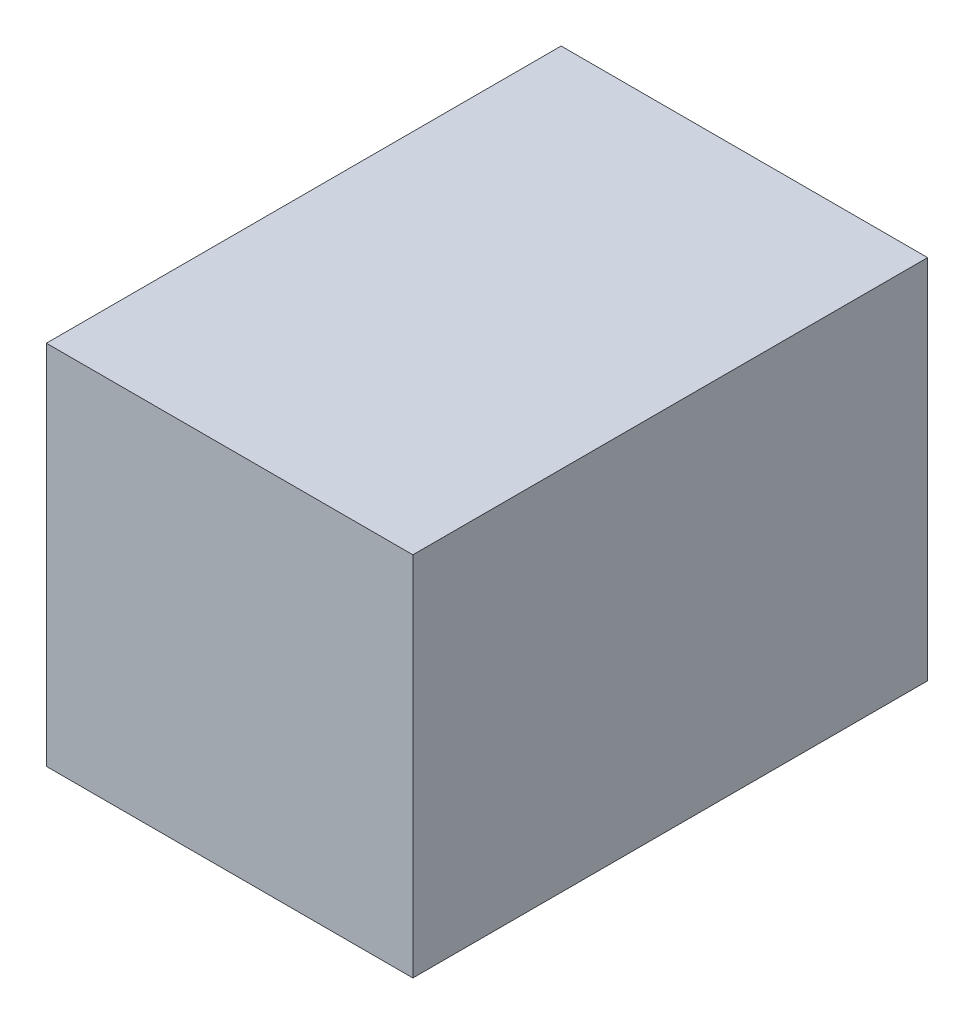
ISO-10303-21;
HEADER;
FILE_DESCRIPTION(('STEP AP214'),'2;1');
FILE_NAME('part.step','',(''),(''),'','','');
FILE_SCHEMA(('AUTOMOTIVE_DESIGN { 1 0 10303 214 1 1 1 1 }'));
ENDSEC;
DATA;
#1=APPLICATION_CONTEXT('core data for automotive mechanical design processes');
#2=APPLICATION_PROTOCOL_DEFINITION('international standard','automotive_design',2000,#1);
#3=PRODUCT_CONTEXT('',#1,'mechanical');
#4=PRODUCT('Part','Part','',(#3));
#5=PRODUCT_RELATED_PRODUCT_CATEGORY('part','',(#4));
#6=PRODUCT_DEFINITION_FORMATION('','',#4);
#7=PRODUCT_DEFINITION_CONTEXT('part definition',#1,'design');
#8=PRODUCT_DEFINITION('design','',#6,#7);
#9=PRODUCT_DEFINITION_SHAPE('','',#8);
#10=(LENGTH_UNIT() NAMED_UNIT(*) SI_UNIT(.MILLI.,.METRE.));
#11=(NAMED_UNIT(*) PLANE_ANGLE_UNIT() SI_UNIT($,.RADIAN.));
#12=(NAMED_UNIT(*) SI_UNIT($,.STERADIAN.) SOLID_ANGLE_UNIT());
#13=UNCERTAINTY_MEASURE_WITH_UNIT(LENGTH_MEASURE(1.E-05),#10,'distance_accuracy_value','');
#14=(GEOMETRIC_REPRESENTATION_CONTEXT(3) GLOBAL_UNCERTAINTY_ASSIGNED_CONTEXT((#13)) GLOBAL_UNIT_ASSIGNED_CONTEXT((#10,
#11,#12)) REPRESENTATION_CONTEXT('',''));
#15=CARTESIAN_POINT('',(0.,0.,0.));
#16=DIRECTION('',(0.,0.,1.));
#17=DIRECTION('',(1.,0.,0.));
#18=AXIS2_PLACEMENT_3D('',#15,#16,#17);
#19=CARTESIAN_POINT('',(71.2,-71.2,100.));
#20=DIRECTION('',(-1.,0.,0.));
#21=DIRECTION('',(0.,0.,1.));
#22=AXIS2_PLACEMENT_3D('',#19,#20,#21);
#23=PLANE('',#22);
#24=DIRECTION('',(0.,1.,0.));
#25=VECTOR('',#24,1.);
#26=CARTESIAN_POINT('',(71.2,-71.2,-100.));
#27=LINE('',#26,#25);
#28=CARTESIAN_POINT('',(71.2,-71.2,-100.));
#29=VERTEX_POINT('',#28);
#30=CARTESIAN_POINT('',(71.2,71.2,-100.));
#31=VERTEX_POINT('',#30);
#32=EDGE_CURVE('E97',#29,#31,#27,.T.);
#33=ORIENTED_EDGE('',*,*,#32,.T.);
#34=DIRECTION('',(0.,0.,-1.));
#35=VECTOR('',#34,1.);
#36=CARTESIAN_POINT('',(71.2,71.2,100.));
#37=LINE('',#36,#35);
#38=CARTESIAN_POINT('',(71.2,71.2,100.));
#39=VERTEX_POINT('',#38);
#40=EDGE_CURVE('E11',#39,#31,#37,.T.);
#41=ORIENTED_EDGE('',*,*,#40,.F.);
#42=DIRECTION('',(0.,1.,0.));
#43=VECTOR('',#42,1.);
#44=CARTESIAN_POINT('',(71.2,-71.2,100.));
#45=LINE('',#44,#43);
#46=CARTESIAN_POINT('',(71.2,-71.2,100.));
#47=VERTEX_POINT('',#46);
#48=EDGE_CURVE('E85',#47,#39,#45,.T.);
#49=ORIENTED_EDGE('',*,*,#48,.F.);
#50=DIRECTION('',(0.,0.,-1.));
#51=VECTOR('',#50,1.);
#52=CARTESIAN_POINT('',(71.2,-71.2,100.));
#53=LINE('',#52,#51);
#54=EDGE_CURVE('E93',#47,#29,#53,.T.);
#55=ORIENTED_EDGE('',*,*,#54,.T.);
#56=EDGE_LOOP('',(#33,#41,#49,#55));
#57=FACE_BOUND('',#56,.T.);
#58=ADVANCED_FACE('F34',(#57),#23,.F.);
#59=CARTESIAN_POINT('',(-71.2,71.2,100.));
#60=DIRECTION('',(0.,-1.,0.));
#61=DIRECTION('',(0.,0.,-1.));
#62=AXIS2_PLACEMENT_3D('',#59,#60,#61);
#63=PLANE('',#62);
#64=DIRECTION('',(-1.,0.,0.));
#65=VECTOR('',#64,1.);
#66=CARTESIAN_POINT('',(-71.2,71.2,-100.));
#67=LINE('',#66,#65);
#68=CARTESIAN_POINT('',(-71.2,71.2,-100.));
#69=VERTEX_POINT('',#68);
#70=EDGE_CURVE('E89',#31,#69,#67,.T.);
#71=ORIENTED_EDGE('',*,*,#70,.T.);
#72=DIRECTION('',(0.,0.,-1.));
#73=VECTOR('',#72,1.);
#74=CARTESIAN_POINT('',(-71.2,71.2,100.));
#75=LINE('',#74,#73);
#76=CARTESIAN_POINT('',(-71.2,71.2,100.));
#77=VERTEX_POINT('',#76);
#78=EDGE_CURVE('E42',#77,#69,#75,.T.);
#79=ORIENTED_EDGE('',*,*,#78,.F.);
#80=DIRECTION('',(-1.,0.,0.));
#81=VECTOR('',#80,1.);
#82=CARTESIAN_POINT('',(-71.2,71.2,100.));
#83=LINE('',#82,#81);
#84=EDGE_CURVE('E80',#39,#77,#83,.T.);
#85=ORIENTED_EDGE('',*,*,#84,.F.);
#86=ORIENTED_EDGE('',*,*,#40,.T.);
#87=EDGE_LOOP('',(#71,#79,#85,#86));
#88=FACE_BOUND('',#87,.T.);
#89=ADVANCED_FACE('F88',(#88),#63,.F.);
#90=CARTESIAN_POINT('',(-71.2,-71.2,100.));
#91=DIRECTION('',(1.,0.,0.));
#92=DIRECTION('',(0.,0.,-1.));
#93=AXIS2_PLACEMENT_3D('',#90,#91,#92);
#94=PLANE('',#93);
#95=DIRECTION('',(0.,-1.,0.));
#96=VECTOR('',#95,1.);
#97=CARTESIAN_POINT('',(-71.2,-71.2,-100.));
#98=LINE('',#97,#96);
#99=CARTESIAN_POINT('',(-71.2,-71.2,-100.));
#100=VERTEX_POINT('',#99);
#101=EDGE_CURVE('E67',#69,#100,#98,.T.);
#102=ORIENTED_EDGE('',*,*,#101,.T.);
#103=DIRECTION('',(0.,0.,-1.));
#104=VECTOR('',#103,1.);
#105=CARTESIAN_POINT('',(-71.2,-71.2,100.));
#106=LINE('',#105,#104);
#107=CARTESIAN_POINT('',(-71.2,-71.2,100.));
#108=VERTEX_POINT('',#107);
#109=EDGE_CURVE('E90',#108,#100,#106,.T.);
#110=ORIENTED_EDGE('',*,*,#109,.F.);
#111=DIRECTION('',(0.,-1.,0.));
#112=VECTOR('',#111,1.);
#113=CARTESIAN_POINT('',(-71.2,-71.2,100.));
#114=LINE('',#113,#112);
#115=EDGE_CURVE('E83',#77,#108,#114,.T.);
#116=ORIENTED_EDGE('',*,*,#115,.F.);
#117=ORIENTED_EDGE('',*,*,#78,.T.);
#118=EDGE_LOOP('',(#102,#110,#116,#117));
#119=FACE_BOUND('',#118,.T.);
#120=ADVANCED_FACE('F91',(#119),#94,.F.);
#121=CARTESIAN_POINT('',(-71.2,-71.2,100.));
#122=DIRECTION('',(0.,1.,0.));
#123=DIRECTION('',(0.,0.,1.));
#124=AXIS2_PLACEMENT_3D('',#121,#122,#123);
#125=PLANE('',#124);
#126=DIRECTION('',(1.,0.,0.));
#127=VECTOR('',#126,1.);
#128=CARTESIAN_POINT('',(-71.2,-71.2,-100.));
#129=LINE('',#128,#127);
#130=EDGE_CURVE('E73',#100,#29,#129,.T.);
#131=ORIENTED_EDGE('',*,*,#130,.T.);
#132=ORIENTED_EDGE('',*,*,#54,.F.);
#133=DIRECTION('',(1.,0.,0.));
#134=VECTOR('',#133,1.);
#135=CARTESIAN_POINT('',(-71.2,-71.2,100.));
#136=LINE('',#135,#134);
#137=EDGE_CURVE('E50',#108,#47,#136,.T.);
#138=ORIENTED_EDGE('',*,*,#137,.F.);
#139=ORIENTED_EDGE('',*,*,#109,.T.);
#140=EDGE_LOOP('',(#131,#132,#138,#139));
#141=FACE_BOUND('',#140,.T.);
#142=ADVANCED_FACE('F105',(#141),#125,.F.);
#143=CARTESIAN_POINT('',(0.,0.,100.));
#144=DIRECTION('',(0.,0.,-1.));
#145=DIRECTION('',(-1.,0.,0.));
#146=AXIS2_PLACEMENT_3D('',#143,#144,#145);
#147=PLANE('',#146);
#148=ORIENTED_EDGE('',*,*,#48,.T.);
#149=ORIENTED_EDGE('',*,*,#84,.T.);
#150=ORIENTED_EDGE('',*,*,#115,.T.);
#151=ORIENTED_EDGE('',*,*,#137,.T.);
#152=EDGE_LOOP('',(#148,#149,#150,#151));
#153=FACE_BOUND('',#152,.T.);
#154=ADVANCED_FACE('F81',(#153),#147,.F.);
#155=CARTESIAN_POINT('',(0.,0.,-100.));
#156=DIRECTION('',(0.,0.,-1.));
#157=DIRECTION('',(-1.,0.,0.));
#158=AXIS2_PLACEMENT_3D('',#155,#156,#157);
#159=PLANE('',#158);
#160=ORIENTED_EDGE('',*,*,#32,.F.);
#161=ORIENTED_EDGE('',*,*,#130,.F.);
#162=ORIENTED_EDGE('',*,*,#101,.F.);
#163=ORIENTED_EDGE('',*,*,#70,.F.);
#164=EDGE_LOOP('',(#160,#161,#162,#163));
#165=FACE_BOUND('',#164,.T.);
#166=ADVANCED_FACE('F108',(#165),#159,.T.);
#167=CLOSED_SHELL('',(#58,#89,#120,#142,#154,#166));
#168=CARTESIAN_POINT('',(0.,0.,82.416));
#169=DIRECTION('',(0.,0.,-1.));
#170=DIRECTION('',(-1.,0.,0.));
#171=AXIS2_PLACEMENT_3D('',#168,#169,#170);
#172=PLANE('',#171);
#173=CARTESIAN_POINT('',(0.,0.,82.416));
#174=DIRECTION('',(0.,0.,1.));
#175=DIRECTION('',(1.,0.,0.));
#176=AXIS2_PLACEMENT_3D('',#173,#174,#175);
#177=CIRCLE('',#176,30.906);
#178=CARTESIAN_POINT('',(30.906,0.,82.416));
#179=VERTEX_POINT('',#178);
#180=EDGE_CURVE('E146',#179,#179,#177,.T.);
#181=ORIENTED_EDGE('',*,*,#180,.F.);
#182=EDGE_LOOP('',(#181));
#183=FACE_BOUND('',#182,.T.);
#184=ADVANCED_FACE('F153',(#183),#172,.T.);
#185=CARTESIAN_POINT('',(0.,0.,-82.416));
#186=DIRECTION('',(0.,0.,1.));
#187=DIRECTION('',(1.,0.,0.));
#188=AXIS2_PLACEMENT_3D('',#185,#186,#187);
#189=PLANE('',#188);
#190=CARTESIAN_POINT('',(0.,0.,-82.416));
#191=DIRECTION('',(0.,0.,1.));
#192=DIRECTION('',(1.,0.,0.));
#193=AXIS2_PLACEMENT_3D('',#190,#191,#192);
#194=CIRCLE('',#193,41.208);
#195=CARTESIAN_POINT('',(41.208,0.,-82.416));
#196=VERTEX_POINT('',#195);
#197=EDGE_CURVE('E100',#196,#196,#194,.T.);
#198=ORIENTED_EDGE('',*,*,#197,.T.);
#199=EDGE_LOOP('',(#198));
#200=FACE_BOUND('',#199,.T.);
#201=ADVANCED_FACE('F155',(#200),#189,.T.);
#202=CARTESIAN_POINT('',(0.,0.,-61.812));
#203=DIRECTION('',(0.,0.,1.));
#204=DIRECTION('',(1.,0.,0.));
#205=AXIS2_PLACEMENT_3D('',#202,#203,#204);
#206=TOROIDAL_SURFACE('',#205,41.208,20.604);
#207=CARTESIAN_POINT('',(0.,0.,-41.208));
#208=DIRECTION('',(0.,0.,1.));
#209=DIRECTION('',(1.,0.,0.));
#210=AXIS2_PLACEMENT_3D('',#207,#208,#209);
#211=CIRCLE('',#210,41.208);
#212=CARTESIAN_POINT('',(41.208,0.,-41.208));
#213=VERTEX_POINT('',#212);
#214=EDGE_CURVE('E113',#213,#213,#211,.T.);
#215=ORIENTED_EDGE('',*,*,#214,.T.);
#216=EDGE_LOOP('',(#215));
#217=FACE_BOUND('',#216,.T.);
#218=ORIENTED_EDGE('',*,*,#197,.F.);
#219=EDGE_LOOP('',(#218));
#220=FACE_BOUND('',#219,.T.);
#221=ADVANCED_FACE('F162',(#217,#220),#206,.F.);
#222=CARTESIAN_POINT('',(0.,0.,-41.208));
#223=DIRECTION('',(0.,0.,-1.));
#224=DIRECTION('',(-1.,0.,0.));
#225=AXIS2_PLACEMENT_3D('',#222,#223,#224);
#226=PLANE('',#225);
#227=CARTESIAN_POINT('',(0.,0.,-41.208));
#228=DIRECTION('',(0.,0.,1.));
#229=DIRECTION('',(1.,0.,0.));
#230=AXIS2_PLACEMENT_3D('',#227,#228,#229);
#231=CIRCLE('',#230,33.4815);
#232=CARTESIAN_POINT('',(33.4815,0.,-41.208));
#233=VERTEX_POINT('',#232);
#234=EDGE_CURVE('E116',#233,#233,#231,.T.);
#235=ORIENTED_EDGE('',*,*,#234,.T.);
#236=EDGE_LOOP('',(#235));
#237=FACE_BOUND('',#236,.T.);
#238=ORIENTED_EDGE('',*,*,#214,.F.);
#239=EDGE_LOOP('',(#238));
#240=FACE_BOUND('',#239,.T.);
#241=ADVANCED_FACE('F227',(#237,#240),#226,.T.);
#242=CARTESIAN_POINT('',(0.,0.,-38.6325));
#243=DIRECTION('',(0.,0.,1.));
#244=DIRECTION('',(1.,0.,0.));
#245=AXIS2_PLACEMENT_3D('',#242,#243,#244);
#246=TOROIDAL_SURFACE('',#245,33.4815,2.5755);
#247=ORIENTED_EDGE('',*,*,#234,.F.);
#248=EDGE_LOOP('',(#247));
#249=FACE_BOUND('',#248,.T.);
#250=CARTESIAN_POINT('',(0.,0.,-38.6325));
#251=DIRECTION('',(0.,0.,1.));
#252=DIRECTION('',(1.,0.,0.));
#253=AXIS2_PLACEMENT_3D('',#250,#251,#252);
#254=CIRCLE('',#253,30.906);
#255=CARTESIAN_POINT('',(30.906,0.,-38.6325));
#256=VERTEX_POINT('',#255);
#257=EDGE_CURVE('E119',#256,#256,#254,.T.);
#258=ORIENTED_EDGE('',*,*,#257,.T.);
#259=EDGE_LOOP('',(#258));
#260=FACE_BOUND('',#259,.T.);
#261=ADVANCED_FACE('F236',(#249,#260),#246,.T.);
#262=CARTESIAN_POINT('',(0.,0.,82.416));
#263=DIRECTION('',(0.,0.,1.));
#264=DIRECTION('',(1.,0.,0.));
#265=AXIS2_PLACEMENT_3D('',#262,#263,#264);
#266=CYLINDRICAL_SURFACE('',#265,30.906);
#267=ORIENTED_EDGE('',*,*,#257,.F.);
#268=EDGE_LOOP('',(#267));
#269=FACE_BOUND('',#268,.T.);
#270=CARTESIAN_POINT('',(0.,0.,-2.57550000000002));
#271=DIRECTION('',(0.,0.,1.));
#272=DIRECTION('',(1.,0.,0.));
#273=AXIS2_PLACEMENT_3D('',#270,#271,#272);
#274=CIRCLE('',#273,30.906);
#275=CARTESIAN_POINT('',(30.906,0.,-2.57550000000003));
#276=VERTEX_POINT('',#275);
#277=EDGE_CURVE('E122',#276,#276,#274,.T.);
#278=ORIENTED_EDGE('',*,*,#277,.T.);
#279=EDGE_LOOP('',(#278));
#280=FACE_BOUND('',#279,.T.);
#281=ADVANCED_FACE('F246',(#269,#280),#266,.F.);
#282=CARTESIAN_POINT('',(0.,0.,-2.57550000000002));
#283=DIRECTION('',(0.,0.,1.));
#284=DIRECTION('',(1.,0.,0.));
#285=AXIS2_PLACEMENT_3D('',#282,#283,#284);
#286=TOROIDAL_SURFACE('',#285,28.3305,2.5755);
#287=CARTESIAN_POINT('',(0.,0.,0.));
#288=DIRECTION('',(0.,0.,1.));
#289=DIRECTION('',(1.,0.,0.));
#290=AXIS2_PLACEMENT_3D('',#287,#288,#289);
#291=CIRCLE('',#290,28.3305);
#292=CARTESIAN_POINT('',(28.3305,0.,0.));
#293=VERTEX_POINT('',#292);
#294=EDGE_CURVE('E125',#293,#293,#291,.T.);
#295=ORIENTED_EDGE('',*,*,#294,.T.);
#296=EDGE_LOOP('',(#295));
#297=FACE_BOUND('',#296,.T.);
#298=ORIENTED_EDGE('',*,*,#277,.F.);
#299=EDGE_LOOP('',(#298));
#300=FACE_BOUND('',#299,.T.);
#301=ADVANCED_FACE('F256',(#297,#300),#286,.F.);
#302=CARTESIAN_POINT('',(0.,0.,0.));
#303=DIRECTION('',(0.,0.,-1.));
#304=DIRECTION('',(-1.,0.,0.));
#305=AXIS2_PLACEMENT_3D('',#302,#303,#304);
#306=PLANE('',#305);
#307=CARTESIAN_POINT('',(0.,0.,0.));
#308=DIRECTION('',(0.,0.,1.));
#309=DIRECTION('',(1.,0.,0.));
#310=AXIS2_PLACEMENT_3D('',#307,#308,#309);
#311=CIRCLE('',#310,25.755);
#312=CARTESIAN_POINT('',(25.755,0.,0.));
#313=VERTEX_POINT('',#312);
#314=EDGE_CURVE('E128',#313,#313,#311,.T.);
#315=ORIENTED_EDGE('',*,*,#314,.T.);
#316=EDGE_LOOP('',(#315));
#317=FACE_BOUND('',#316,.T.);
#318=ORIENTED_EDGE('',*,*,#294,.F.);
#319=EDGE_LOOP('',(#318));
#320=FACE_BOUND('',#319,.T.);
#321=ADVANCED_FACE('F266',(#317,#320),#306,.T.);
#322=CARTESIAN_POINT('',(0.,0.,5.15099999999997));
#323=DIRECTION('',(0.,0.,1.));
#324=DIRECTION('',(1.,0.,0.));
#325=AXIS2_PLACEMENT_3D('',#322,#323,#324);
#326=TOROIDAL_SURFACE('',#325,25.755,5.151);
#327=ORIENTED_EDGE('',*,*,#314,.F.);
#328=EDGE_LOOP('',(#327));
#329=FACE_BOUND('',#328,.T.);
#330=CARTESIAN_POINT('',(0.,0.,5.15099999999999));
#331=DIRECTION('',(0.,0.,1.));
#332=DIRECTION('',(1.,0.,0.));
#333=AXIS2_PLACEMENT_3D('',#330,#331,#332);
#334=CIRCLE('',#333,20.604);
#335=CARTESIAN_POINT('',(20.604,0.,5.15099999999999));
#336=VERTEX_POINT('',#335);
#337=EDGE_CURVE('E131',#336,#336,#334,.T.);
#338=ORIENTED_EDGE('',*,*,#337,.T.);
#339=EDGE_LOOP('',(#338));
#340=FACE_BOUND('',#339,.T.);
#341=ADVANCED_FACE('F276',(#329,#340),#326,.T.);
#342=CARTESIAN_POINT('',(0.,0.,82.416));
#343=DIRECTION('',(0.,0.,1.));
#344=DIRECTION('',(1.,0.,0.));
#345=AXIS2_PLACEMENT_3D('',#342,#343,#344);
#346=CYLINDRICAL_SURFACE('',#345,20.604);
#347=CARTESIAN_POINT('',(0.,0.,20.604));
#348=DIRECTION('',(0.,0.,1.));
#349=DIRECTION('',(1.,0.,0.));
#350=AXIS2_PLACEMENT_3D('',#347,#348,#349);
#351=CIRCLE('',#350,20.604);
#352=CARTESIAN_POINT('',(20.604,0.,20.604));
#353=VERTEX_POINT('',#352);
#354=EDGE_CURVE('E134',#353,#353,#351,.T.);
#355=ORIENTED_EDGE('',*,*,#354,.T.);
#356=EDGE_LOOP('',(#355));
#357=FACE_BOUND('',#356,.T.);
#358=ORIENTED_EDGE('',*,*,#337,.F.);
#359=EDGE_LOOP('',(#358));
#360=FACE_BOUND('',#359,.T.);
#361=ADVANCED_FACE('F286',(#357,#360),#346,.F.);
#362=CARTESIAN_POINT('',(0.,0.,20.604));
#363=DIRECTION('',(0.,0.,1.));
#364=DIRECTION('',(1.,0.,0.));
#365=AXIS2_PLACEMENT_3D('',#362,#363,#364);
#366=TOROIDAL_SURFACE('',#365,30.906,10.302);
#367=ORIENTED_EDGE('',*,*,#354,.F.);
#368=EDGE_LOOP('',(#367));
#369=FACE_BOUND('',#368,.T.);
#370=CARTESIAN_POINT('',(0.,0.,30.906));
#371=DIRECTION('',(0.,0.,1.));
#372=DIRECTION('',(1.,0.,0.));
#373=AXIS2_PLACEMENT_3D('',#370,#371,#372);
#374=CIRCLE('',#373,30.906);
#375=CARTESIAN_POINT('',(30.906,0.,30.906));
#376=VERTEX_POINT('',#375);
#377=EDGE_CURVE('E137',#376,#376,#374,.T.);
#378=ORIENTED_EDGE('',*,*,#377,.T.);
#379=EDGE_LOOP('',(#378));
#380=FACE_BOUND('',#379,.T.);
#381=ADVANCED_FACE('F296',(#369,#380),#366,.T.);
#382=CARTESIAN_POINT('',(0.,0.,46.359));
#383=DIRECTION('',(0.,0.,1.));
#384=DIRECTION('',(1.,0.,0.));
#385=AXIS2_PLACEMENT_3D('',#382,#383,#384);
#386=TOROIDAL_SURFACE('',#385,30.906,15.453);
#387=CARTESIAN_POINT('',(0.,0.,60.5219084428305));
#388=DIRECTION('',(0.,0.,1.));
#389=DIRECTION('',(1.,0.,0.));
#390=AXIS2_PLACEMENT_3D('',#387,#388,#389);
#391=CIRCLE('',#390,37.0872);
#392=CARTESIAN_POINT('',(37.0872,0.,60.5219084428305));
#393=VERTEX_POINT('',#392);
#394=EDGE_CURVE('E140',#393,#393,#391,.T.);
#395=ORIENTED_EDGE('',*,*,#394,.T.);
#396=EDGE_LOOP('',(#395));
#397=FACE_BOUND('',#396,.T.);
#398=ORIENTED_EDGE('',*,*,#377,.F.);
#399=EDGE_LOOP('',(#398));
#400=FACE_BOUND('',#399,.T.);
#401=ADVANCED_FACE('F306',(#397,#400),#386,.F.);
#402=CARTESIAN_POINT('',(0.,0.,69.9638474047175));
#403=DIRECTION('',(0.,0.,1.));
#404=DIRECTION('',(1.,0.,0.));
#405=AXIS2_PLACEMENT_3D('',#402,#403,#404);
#406=TOROIDAL_SURFACE('',#405,41.208,10.302);
#407=ORIENTED_EDGE('',*,*,#394,.F.);
#408=EDGE_LOOP('',(#407));
#409=FACE_BOUND('',#408,.T.);
#410=CARTESIAN_POINT('',(0.,0.,69.9638474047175));
#411=DIRECTION('',(0.,0.,1.));
#412=DIRECTION('',(1.,0.,0.));
#413=AXIS2_PLACEMENT_3D('',#410,#411,#412);
#414=CIRCLE('',#413,30.906);
#415=CARTESIAN_POINT('',(30.906,0.,69.9638474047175));
#416=VERTEX_POINT('',#415);
#417=EDGE_CURVE('E143',#416,#416,#414,.T.);
#418=ORIENTED_EDGE('',*,*,#417,.T.);
#419=EDGE_LOOP('',(#418));
#420=FACE_BOUND('',#419,.T.);
#421=ADVANCED_FACE('F316',(#409,#420),#406,.T.);
#422=CARTESIAN_POINT('',(0.,0.,82.416));
#423=DIRECTION('',(0.,0.,1.));
#424=DIRECTION('',(1.,0.,0.));
#425=AXIS2_PLACEMENT_3D('',#422,#423,#424);
#426=CYLINDRICAL_SURFACE('',#425,30.906);
#427=ORIENTED_EDGE('',*,*,#180,.T.);
#428=EDGE_LOOP('',(#427));
#429=FACE_BOUND('',#428,.T.);
#430=ORIENTED_EDGE('',*,*,#417,.F.);
#431=EDGE_LOOP('',(#430));
#432=FACE_BOUND('',#431,.T.);
#433=ADVANCED_FACE('F150',(#429,#432),#426,.F.);
#434=CLOSED_SHELL('',(#184,#201,#221,#241,#261,#281,#301,#321,#341,#361,#381,#401,#421,#433));
#435=ORIENTED_CLOSED_SHELL('',*,#434,.T.);
#436=BREP_WITH_VOIDS('B2',#167,(#435));
#437=ADVANCED_BREP_SHAPE_REPRESENTATION('',(#18,#436),#14);
#438=SHAPE_DEFINITION_REPRESENTATION(#9,#437);
ENDSEC;
END-ISO-10303-21;
